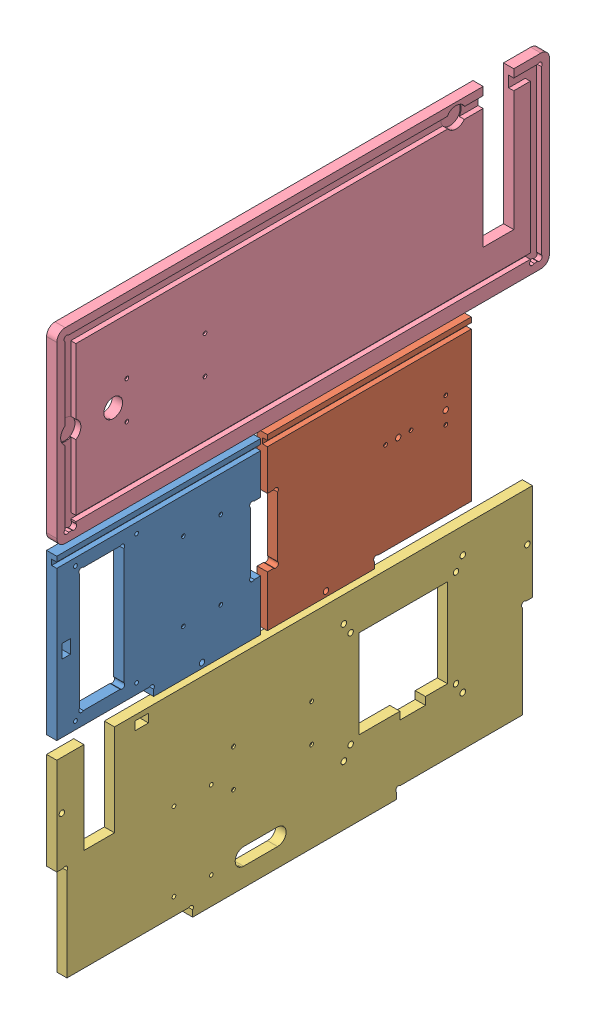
SolidWorks assembly Pièces PVC 6 jaune à plat.SLDASM, configuration Défaut (file format 6000). Lengths in mm.
Overall size (6 338 290).
4 component instances, 4 part files, 9 mates.
Components (placement in the parent):
- Arrière pilier-3: Arrière pilier.SLDPRT [Défaut] at (-87.8866 -133.3739 1214.554) x (0 1 0) z (1 0 0) size (100 120 6)
- Devant pilier-2: Devant pilier.SLDPRT [Défaut] at (-81.8866 -133.3739 1198.554) x (0 1 0) z (-1 0 0) size (100 120 6)
- Côté gauche pilier-1: Côté gauche pilier.SLDPRT [Défaut] at (-81.8866 -307.3739 1188.554) x (-1 0 0) z (0 0 -1) size (6 120 280)
- Dessus-1: Dessus.SLDPRT [Défaut] at (-81.8866 30.6261 1328.554) x (0 0 -1) z (0 1 0) size (290 6 110)
Mates (geometry in assembly coordinates):
- Distance2: distance = 4 mm anti-aligned: plane of Devant pilier-2 through (-87.8866 -83.3739 1204.554) normal (0 0 1); plane of Arrière pilier-3 through (-81.8866 -83.3739 1208.554) normal (0 0 -1)
- Coïncidente6: coincident aligned: plane of Arrière pilier-3 through (-81.8866 -83.3739 1328.554) normal (0 1 0); plane of Devant pilier-2 through (-87.8866 -83.3739 1084.554) normal (0 1 0)
- Coïncidente7: coincident aligned: plane of Devant pilier-2 through (-87.8866 -114.5052 1199.6853) normal (-1 0 0); plane of Côté gauche pilier-1 through (-87.8866 -302.5052 1249.6853) normal (-1 0 0)
- Coïncidente8: coincident aligned: plane of Arrière pilier-3 through (-81.8866 -177.3739 1328.554) normal (0 0 1); plane of Côté gauche pilier-1 through (-87.8866 -244.3739 1328.554) normal (0 0 1)
- Distance3: distance = 4 mm: line of Arrière pilier-3 through (-81.8866 -183.3739 1271.554) axis (0 0 -1); line of Côté gauche pilier-1 through (-81.8866 -187.3739 1294.554) axis (0 0 -1)
- Coïncidente10: coincident aligned: plane of Arrière pilier-3 through (-87.8866 -114.5052 1213.4226) normal (-1 0 0); plane of Devant pilier-2 through (-87.8866 -114.5052 1199.6853) normal (-1 0 0)
- Coïncidente11: coincident aligned: plane of Arrière pilier-3 through (-87.8866 -114.5052 1213.4226) normal (-1 0 0); plane of Dessus-1 through (-87.8866 25.6261 1043.554) normal (-1 0 0)
- Distance4: distance = 4 mm anti-aligned: plane of Arrière pilier-3 through (-81.8866 -83.3739 1328.554) normal (0 1 0); plane of Dessus-1 through (-87.8866 -79.3739 1323.554) normal (0 -1 0)
- Coïncidente13: coincident aligned: plane of Arrière pilier-3 through (-81.8866 -177.3739 1328.554) normal (0 0 1); plane of Dessus-1 through (-87.8866 25.6261 1328.554) normal (0 0 1)
